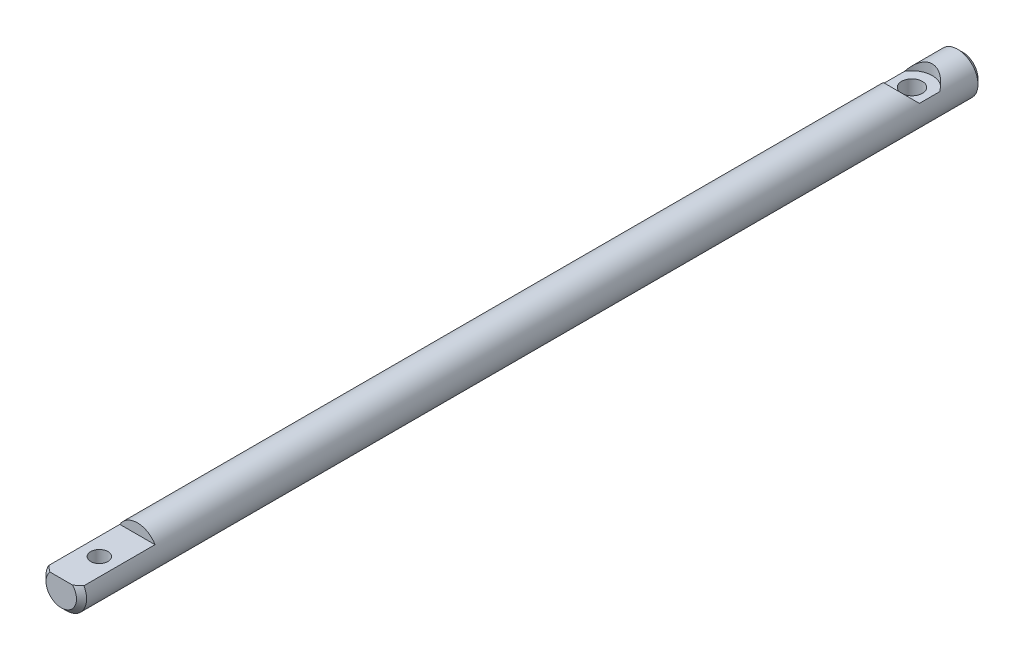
ISO-10303-21;
HEADER;
FILE_DESCRIPTION(('STEP AP214'),'2;1');
FILE_NAME('part.step','',(''),(''),'','','');
FILE_SCHEMA(('AUTOMOTIVE_DESIGN { 1 0 10303 214 1 1 1 1 }'));
ENDSEC;
DATA;
#1=APPLICATION_CONTEXT('core data for automotive mechanical design processes');
#2=APPLICATION_PROTOCOL_DEFINITION('international standard','automotive_design',2000,#1);
#3=PRODUCT_CONTEXT('',#1,'mechanical');
#4=PRODUCT('Part','Part','',(#3));
#5=PRODUCT_RELATED_PRODUCT_CATEGORY('part','',(#4));
#6=PRODUCT_DEFINITION_FORMATION('','',#4);
#7=PRODUCT_DEFINITION_CONTEXT('part definition',#1,'design');
#8=PRODUCT_DEFINITION('design','',#6,#7);
#9=PRODUCT_DEFINITION_SHAPE('','',#8);
#10=(LENGTH_UNIT() NAMED_UNIT(*) SI_UNIT(.MILLI.,.METRE.));
#11=(NAMED_UNIT(*) PLANE_ANGLE_UNIT() SI_UNIT($,.RADIAN.));
#12=(NAMED_UNIT(*) SI_UNIT($,.STERADIAN.) SOLID_ANGLE_UNIT());
#13=UNCERTAINTY_MEASURE_WITH_UNIT(LENGTH_MEASURE(1.E-05),#10,'distance_accuracy_value','');
#14=(GEOMETRIC_REPRESENTATION_CONTEXT(3) GLOBAL_UNCERTAINTY_ASSIGNED_CONTEXT((#13)) GLOBAL_UNIT_ASSIGNED_CONTEXT((#10,
#11,#12)) REPRESENTATION_CONTEXT('',''));
#15=CARTESIAN_POINT('',(0.,0.,0.));
#16=DIRECTION('',(0.,0.,1.));
#17=DIRECTION('',(1.,0.,0.));
#18=AXIS2_PLACEMENT_3D('',#15,#16,#17);
#19=CARTESIAN_POINT('',(0.,0.,355.));
#20=DIRECTION('',(0.,0.,-1.));
#21=DIRECTION('',(-1.,0.,0.));
#22=AXIS2_PLACEMENT_3D('',#19,#20,#21);
#23=CYLINDRICAL_SURFACE('',#22,8.);
#24=CARTESIAN_POINT('',(0.,-8.,343.4));
#25=CARTESIAN_POINT('',(0.09094254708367,-7.99999921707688,343.399998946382));
#26=CARTESIAN_POINT('',(0.181917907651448,-7.99844346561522,343.39634381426));
#27=CARTESIAN_POINT('',(0.363195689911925,-7.99226793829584,343.381771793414));
#28=CARTESIAN_POINT('',(0.453497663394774,-7.98764627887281,343.370850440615));
#29=CARTESIAN_POINT('',(0.722727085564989,-7.96931026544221,343.327261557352));
#30=CARTESIAN_POINT('',(0.899738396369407,-7.95112529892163,343.28376952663));
#31=CARTESIAN_POINT('',(1.24264964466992,-7.90479388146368,343.169925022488));
#32=CARTESIAN_POINT('',(1.40858555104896,-7.87668175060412,343.099665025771));
#33=CARTESIAN_POINT('',(1.72618850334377,-7.8132255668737,342.934669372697));
#34=CARTESIAN_POINT('',(1.87785953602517,-7.77788354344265,342.839940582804));
#35=CARTESIAN_POINT('',(2.17068103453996,-7.70143718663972,342.623519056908));
#36=CARTESIAN_POINT('',(2.31099328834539,-7.66013924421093,342.500761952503));
#37=CARTESIAN_POINT('',(2.56976762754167,-7.57725465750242,342.23402134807));
#38=CARTESIAN_POINT('',(2.68821777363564,-7.53566786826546,342.090026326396));
#39=CARTESIAN_POINT('',(2.90595853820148,-7.45450317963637,341.775886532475));
#40=CARTESIAN_POINT('',(3.00394296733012,-7.41514010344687,341.604775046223));
#41=CARTESIAN_POINT('',(3.16936499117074,-7.34596652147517,341.246587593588));
#42=CARTESIAN_POINT('',(3.23681894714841,-7.31615090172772,341.059520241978));
#43=CARTESIAN_POINT('',(3.33577021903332,-7.27155199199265,340.684374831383));
#44=CARTESIAN_POINT('',(3.3688832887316,-7.25609717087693,340.49680595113));
#45=CARTESIAN_POINT('',(3.40324961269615,-7.24004769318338,340.118186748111));
#46=CARTESIAN_POINT('',(3.40452147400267,-7.2394443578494,339.927138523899));
#47=CARTESIAN_POINT('',(3.37638260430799,-7.25260004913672,339.563385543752));
#48=CARTESIAN_POINT('',(3.34942959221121,-7.26520868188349,339.390440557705));
#49=CARTESIAN_POINT('',(3.26974117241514,-7.30141681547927,339.051811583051));
#50=CARTESIAN_POINT('',(3.21700058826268,-7.3250185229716,338.886129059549));
#51=CARTESIAN_POINT('',(3.08619769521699,-7.3810921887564,338.562458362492));
#52=CARTESIAN_POINT('',(3.00761142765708,-7.41374528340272,338.404714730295));
#53=CARTESIAN_POINT('',(2.82772003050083,-7.48420446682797,338.10402377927));
#54=CARTESIAN_POINT('',(2.72640574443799,-7.52201263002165,337.961082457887));
#55=CARTESIAN_POINT('',(2.49344288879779,-7.602579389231,337.680773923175));
#56=CARTESIAN_POINT('',(2.35990618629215,-7.64548038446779,337.545012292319));
#57=CARTESIAN_POINT('',(2.07155336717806,-7.72859409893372,337.297258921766));
#58=CARTESIAN_POINT('',(1.91673187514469,-7.76880613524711,337.185273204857));
#59=CARTESIAN_POINT('',(1.5851569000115,-7.84326580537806,336.985764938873));
#60=CARTESIAN_POINT('',(1.40795338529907,-7.87734004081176,336.898920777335));
#61=CARTESIAN_POINT('',(1.0396330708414,-7.93434300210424,336.756843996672));
#62=CARTESIAN_POINT('',(0.848524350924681,-7.95727814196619,336.701593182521));
#63=CARTESIAN_POINT('',(0.471214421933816,-7.98820555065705,336.627690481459));
#64=CARTESIAN_POINT('',(0.285506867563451,-7.99707532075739,336.606885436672));
#65=CARTESIAN_POINT('',(-0.086943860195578,-8.0016925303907,336.596014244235));
#66=CARTESIAN_POINT('',(-0.273686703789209,-7.99744393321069,336.605938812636));
#67=CARTESIAN_POINT('',(-0.632656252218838,-7.9768675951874,336.654726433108));
#68=CARTESIAN_POINT('',(-0.805132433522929,-7.96118050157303,336.692055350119));
#69=CARTESIAN_POINT('',(-1.14117130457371,-7.92000024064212,336.792432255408));
#70=CARTESIAN_POINT('',(-1.30473287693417,-7.89450584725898,336.855483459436));
#71=CARTESIAN_POINT('',(-1.62406863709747,-7.83515237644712,337.007566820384));
#72=CARTESIAN_POINT('',(-1.77944074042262,-7.8010571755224,337.097348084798));
#73=CARTESIAN_POINT('',(-2.07347297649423,-7.72811073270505,337.299522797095));
#74=CARTESIAN_POINT('',(-2.21212597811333,-7.68925747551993,337.411925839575));
#75=CARTESIAN_POINT('',(-2.47960841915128,-7.6073999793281,337.665899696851));
#76=CARTESIAN_POINT('',(-2.60694543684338,-7.56430165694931,337.80901596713));
#77=CARTESIAN_POINT('',(-2.8362370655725,-7.48135433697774,338.115230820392));
#78=CARTESIAN_POINT('',(-2.9381850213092,-7.44150619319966,338.278334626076));
#79=CARTESIAN_POINT('',(-3.11516255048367,-7.36919895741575,338.623764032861));
#80=CARTESIAN_POINT('',(-3.18971126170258,-7.33687520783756,338.806366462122));
#81=CARTESIAN_POINT('',(-3.30634430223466,-7.28506932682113,339.183344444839));
#82=CARTESIAN_POINT('',(-3.34845686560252,-7.26557602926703,339.377709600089));
#83=CARTESIAN_POINT('',(-3.39616357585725,-7.2433902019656,339.756068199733));
#84=CARTESIAN_POINT('',(-3.40439189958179,-7.23948653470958,339.939659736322));
#85=CARTESIAN_POINT('',(-3.39118684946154,-7.24568206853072,340.305512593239));
#86=CARTESIAN_POINT('',(-3.36975849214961,-7.25577890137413,340.487774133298));
#87=CARTESIAN_POINT('',(-3.30009044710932,-7.28771189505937,340.836308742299));
#88=CARTESIAN_POINT('',(-3.25325576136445,-7.30893106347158,341.002924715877));
#89=CARTESIAN_POINT('',(-3.13550889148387,-7.36020954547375,341.32595617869));
#90=CARTESIAN_POINT('',(-3.06458988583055,-7.39027136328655,341.482368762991));
#91=CARTESIAN_POINT('',(-2.89568117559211,-7.45813580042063,341.79105143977));
#92=CARTESIAN_POINT('',(-2.79629603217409,-7.49630051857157,341.942476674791));
#93=CARTESIAN_POINT('',(-2.57517933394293,-7.57510460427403,342.227325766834));
#94=CARTESIAN_POINT('',(-2.45343953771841,-7.61574488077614,342.360742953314));
#95=CARTESIAN_POINT('',(-2.17997991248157,-7.6986775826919,342.616366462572));
#96=CARTESIAN_POINT('',(-2.02667281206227,-7.74085601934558,342.736916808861));
#97=CARTESIAN_POINT('',(-1.70035343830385,-7.81900500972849,342.950725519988));
#98=CARTESIAN_POINT('',(-1.52733227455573,-7.85497274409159,343.043971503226));
#99=CARTESIAN_POINT('',(-1.25808018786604,-7.9009768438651,343.16016577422));
#100=CARTESIAN_POINT('',(-1.16739003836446,-7.91491510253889,343.194786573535));
#101=CARTESIAN_POINT('',(-0.983036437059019,-7.93991589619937,343.256233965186));
#102=CARTESIAN_POINT('',(-0.889374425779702,-7.95097980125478,343.283064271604));
#103=CARTESIAN_POINT('',(-0.700027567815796,-7.96988077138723,343.328577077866));
#104=CARTESIAN_POINT('',(-0.604348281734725,-7.97772573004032,343.34727951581));
#105=CARTESIAN_POINT('',(-0.411567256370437,-7.98998906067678,343.376403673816));
#106=CARTESIAN_POINT('',(-0.314466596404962,-7.99440990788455,343.386831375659));
#107=CARTESIAN_POINT('',(-0.180959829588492,-7.99803498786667,343.395374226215));
#108=CARTESIAN_POINT('',(-0.144795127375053,-7.99877139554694,343.39710832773));
#109=CARTESIAN_POINT('',(-0.0724220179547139,-7.99975405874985,343.399421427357));
#110=CARTESIAN_POINT('',(-0.0362136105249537,-8.00000031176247,343.400000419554));
#111=CARTESIAN_POINT('',(0.,-8.,343.4));
#112=B_SPLINE_CURVE_WITH_KNOTS('',3,(#24,#25,#26,#27,#28,#29,#30,#31,#32,#33,#34,#35,#36,#37,
#38,#39,#40,#41,#42,#43,#44,#45,#46,#47,#48,#49,#50,#51,#52,#53,#54,#55,#56,#57,#58,#59,#60,#61,
#62,#63,#64,#65,#66,#67,#68,#69,#70,#71,#72,#73,#74,#75,#76,#77,#78,#79,#80,#81,#82,#83,#84,#85,
#86,#87,#88,#89,#90,#91,#92,#93,#94,#95,#96,#97,#98,#99,#100,#101,#102,#103,#104,#105,#106,#107,
#108,#109,#110,#111),.UNSPECIFIED.,.T.,.F.,(4,2,2,2,2,2,2,2,2,2,2,2,2,2,2,2,2,2,2,2,2,2,2,2,2,2,
2,2,2,2,2,2,2,2,2,2,2,2,2,2,2,2,2,4),(0.,0.272787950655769,0.545743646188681,1.09236438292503,
1.63711355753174,2.1817100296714,2.75209343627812,3.32278742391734,3.92296880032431,
4.52282815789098,5.09297031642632,5.66277929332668,6.18679320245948,6.71091234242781,
7.24638921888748,7.78208221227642,8.36505761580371,8.94818051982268,9.54581973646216,
10.1431144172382,10.7014292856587,11.2595754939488,11.7886515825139,12.3177938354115,
12.8634424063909,13.4093228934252,13.9957102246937,14.582251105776,15.1786431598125,
15.7745154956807,16.3230734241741,16.8715385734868,17.3923747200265,17.9133585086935,
18.4663494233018,19.0195446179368,19.6153656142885,20.2114563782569,20.505338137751,
20.7990795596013,21.0920962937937,21.384901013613,21.4935254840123,21.6021505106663),.UNSPECIFIED.);
#113=CARTESIAN_POINT('',(0.,-8.00000000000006,336.6));
#114=VERTEX_POINT('',#113);
#115=CARTESIAN_POINT('',(0.,-8.,343.4));
#116=VERTEX_POINT('',#115);
#117=EDGE_CURVE('E37',#114,#116,#112,.T.);
#118=ORIENTED_EDGE('',*,*,#117,.T.);
#119=EDGE_CURVE('E11',#116,#114,#112,.T.);
#120=ORIENTED_EDGE('',*,*,#119,.T.);
#121=EDGE_LOOP('',(#118,#120));
#122=FACE_BOUND('',#121,.T.);
#123=DIRECTION('',(0.,0.,-1.));
#124=VECTOR('',#123,1.);
#125=CARTESIAN_POINT('',(-6.92820323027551,3.99999999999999,355.));
#126=LINE('',#125,#124);
#127=CARTESIAN_POINT('',(-6.92820323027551,3.99999999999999,353.));
#128=VERTEX_POINT('',#127);
#129=CARTESIAN_POINT('',(-6.92820323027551,4.,325.));
#130=VERTEX_POINT('',#129);
#131=EDGE_CURVE('E95',#128,#130,#126,.T.);
#132=ORIENTED_EDGE('',*,*,#131,.T.);
#133=CARTESIAN_POINT('',(0.,0.,325.));
#134=DIRECTION('',(0.,0.,-1.));
#135=DIRECTION('',(-1.,0.,0.));
#136=AXIS2_PLACEMENT_3D('',#133,#134,#135);
#137=CIRCLE('',#136,8.);
#138=CARTESIAN_POINT('',(6.92820323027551,4.,325.));
#139=VERTEX_POINT('',#138);
#140=EDGE_CURVE('E87',#130,#139,#137,.T.);
#141=ORIENTED_EDGE('',*,*,#140,.T.);
#142=DIRECTION('',(0.,0.,-1.));
#143=VECTOR('',#142,1.);
#144=CARTESIAN_POINT('',(6.92820323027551,3.99999999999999,355.));
#145=LINE('',#144,#143);
#146=CARTESIAN_POINT('',(6.92820323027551,3.99999999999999,353.));
#147=VERTEX_POINT('',#146);
#148=EDGE_CURVE('E188',#139,#147,#145,.F.);
#149=ORIENTED_EDGE('',*,*,#148,.T.);
#150=CARTESIAN_POINT('',(0.,0.,353.));
#151=DIRECTION('',(0.,0.,1.));
#152=DIRECTION('',(1.,0.,0.));
#153=AXIS2_PLACEMENT_3D('',#150,#151,#152);
#154=CIRCLE('',#153,8.);
#155=EDGE_CURVE('E151',#147,#128,#154,.F.);
#156=ORIENTED_EDGE('',*,*,#155,.T.);
#157=EDGE_LOOP('',(#132,#141,#149,#156));
#158=FACE_BOUND('',#157,.T.);
#159=CARTESIAN_POINT('',(0.,0.,2.00000000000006));
#160=DIRECTION('',(0.,0.,1.));
#161=DIRECTION('',(1.,0.,0.));
#162=AXIS2_PLACEMENT_3D('',#159,#160,#161);
#163=CIRCLE('',#162,8.);
#164=CARTESIAN_POINT('',(8.,0.,2.00000000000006));
#165=VERTEX_POINT('',#164);
#166=EDGE_CURVE('E99',#165,#165,#163,.T.);
#167=ORIENTED_EDGE('',*,*,#166,.T.);
#168=EDGE_LOOP('',(#167));
#169=FACE_BOUND('',#168,.T.);
#170=CARTESIAN_POINT('',(0.,-8.,24.1));
#171=CARTESIAN_POINT('',(0.107494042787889,-7.99999985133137,24.0999998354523));
#172=CARTESIAN_POINT('',(0.214990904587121,-7.99782841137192,24.0957676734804));
#173=CARTESIAN_POINT('',(0.429187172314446,-7.98919866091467,24.0788903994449));
#174=CARTESIAN_POINT('',(0.53588624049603,-7.98273862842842,24.0662419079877));
#175=CARTESIAN_POINT('',(0.74778503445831,-7.96568411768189,24.0326585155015));
#176=CARTESIAN_POINT('',(0.852982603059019,-7.95508421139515,24.0117127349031));
#177=CARTESIAN_POINT('',(1.06099795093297,-7.93002449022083,23.9617857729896));
#178=CARTESIAN_POINT('',(1.16381473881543,-7.91556309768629,23.9328013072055));
#179=CARTESIAN_POINT('',(1.46675025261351,-7.86703166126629,23.8345121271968));
#180=CARTESIAN_POINT('',(1.66243590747,-7.82772192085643,23.7536966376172));
#181=CARTESIAN_POINT('',(2.03705065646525,-7.73870988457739,23.5643494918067));
#182=CARTESIAN_POINT('',(2.2159805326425,-7.68900807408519,23.4558191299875));
#183=CARTESIAN_POINT('',(2.56475195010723,-7.58006903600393,23.2063698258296));
#184=CARTESIAN_POINT('',(2.73332265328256,-7.52042958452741,23.0638482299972));
#185=CARTESIAN_POINT('',(3.04532910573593,-7.39959668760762,22.7539850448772));
#186=CARTESIAN_POINT('',(3.18874465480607,-7.33840203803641,22.5866237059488));
#187=CARTESIAN_POINT('',(3.4583432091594,-7.21551020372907,22.2150981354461));
#188=CARTESIAN_POINT('',(3.58212768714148,-7.15418823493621,22.0090366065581));
#189=CARTESIAN_POINT('',(3.74004025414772,-7.07217287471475,21.6842337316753));
#190=CARTESIAN_POINT('',(3.78806176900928,-7.04648880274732,21.5733081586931));
#191=CARTESIAN_POINT('',(3.87434995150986,-6.99941617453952,21.346871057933));
#192=CARTESIAN_POINT('',(3.91262252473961,-6.97802501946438,21.2313623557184));
#193=CARTESIAN_POINT('',(3.97689452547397,-6.94158437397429,21.0037158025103));
#194=CARTESIAN_POINT('',(4.0034962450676,-6.92622958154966,20.8917966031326));
#195=CARTESIAN_POINT('',(4.0472519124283,-6.90075324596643,20.6655903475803));
#196=CARTESIAN_POINT('',(4.06441099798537,-6.89062885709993,20.5513046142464));
#197=CARTESIAN_POINT('',(4.08901604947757,-6.87605656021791,20.3214080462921));
#198=CARTESIAN_POINT('',(4.09646859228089,-6.87160480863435,20.2057981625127));
#199=CARTESIAN_POINT('',(4.10155356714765,-6.86857105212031,19.9742925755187));
#200=CARTESIAN_POINT('',(4.09918702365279,-6.86998843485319,19.8583969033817));
#201=CARTESIAN_POINT('',(4.08560387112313,-6.87807325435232,19.642187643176));
#202=CARTESIAN_POINT('',(4.0755550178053,-6.88404773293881,19.5417727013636));
#203=CARTESIAN_POINT('',(4.0481543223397,-6.90019495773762,19.3422763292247));
#204=CARTESIAN_POINT('',(4.03080020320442,-6.91036901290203,19.2431953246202));
#205=CARTESIAN_POINT('',(3.96805760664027,-6.94672036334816,18.9489791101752));
#206=CARTESIAN_POINT('',(3.9119795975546,-6.97873289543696,18.7567282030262));
#207=CARTESIAN_POINT('',(3.77199067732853,-7.05538983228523,18.3802966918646));
#208=CARTESIAN_POINT('',(3.68746618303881,-7.10030920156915,18.1964054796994));
#209=CARTESIAN_POINT('',(3.49344117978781,-7.19775253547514,17.8444823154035));
#210=CARTESIAN_POINT('',(3.38392944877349,-7.25027991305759,17.6764575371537));
#211=CARTESIAN_POINT('',(3.12597058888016,-7.36551680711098,17.3373689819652));
#212=CARTESIAN_POINT('',(2.97427140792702,-7.42864709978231,17.1689198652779));
#213=CARTESIAN_POINT('',(2.64447217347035,-7.55233152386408,16.8586668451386));
#214=CARTESIAN_POINT('',(2.46635834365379,-7.61288428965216,16.7168769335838));
#215=CARTESIAN_POINT('',(2.17730820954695,-7.69871350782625,16.5238361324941));
#216=CARTESIAN_POINT('',(2.07452946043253,-7.72711013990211,16.4615186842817));
#217=CARTESIAN_POINT('',(1.86327042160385,-7.78075019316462,16.345864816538));
#218=CARTESIAN_POINT('',(1.75479257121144,-7.80599494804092,16.2925245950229));
#219=CARTESIAN_POINT('',(1.53288844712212,-7.85258587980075,16.1954082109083));
#220=CARTESIAN_POINT('',(1.41946431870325,-7.87393372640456,16.1516279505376));
#221=CARTESIAN_POINT('',(1.18848379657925,-7.9120919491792,16.0741449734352));
#222=CARTESIAN_POINT('',(1.07092790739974,-7.92890287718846,16.0404410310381));
#223=CARTESIAN_POINT('',(0.842886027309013,-7.95622918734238,15.9860136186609));
#224=CARTESIAN_POINT('',(0.732655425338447,-7.96716007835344,15.9644264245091));
#225=CARTESIAN_POINT('',(0.510447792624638,-7.98447602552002,15.9303472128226));
#226=CARTESIAN_POINT('',(0.398470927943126,-7.99086151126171,15.9178543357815));
#227=CARTESIAN_POINT('',(0.173745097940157,-7.99890299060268,15.9021353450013));
#228=CARTESIAN_POINT('',(0.0609964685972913,-8.00056092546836,15.8989054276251));
#229=CARTESIAN_POINT('',(-0.164348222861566,-7.99910527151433,15.9017459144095));
#230=CARTESIAN_POINT('',(-0.276944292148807,-7.99599191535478,15.9078158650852));
#231=CARTESIAN_POINT('',(-0.491764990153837,-7.98553405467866,15.9282896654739));
#232=CARTESIAN_POINT('',(-0.594077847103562,-7.9785604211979,15.9419634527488));
#233=CARTESIAN_POINT('',(-0.79707646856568,-7.96084639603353,15.9769048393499));
#234=CARTESIAN_POINT('',(-0.897761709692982,-7.9501048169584,15.9981748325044));
#235=CARTESIAN_POINT('',(-1.19630409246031,-7.91258038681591,16.0730607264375));
#236=CARTESIAN_POINT('',(-1.39083941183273,-7.88048785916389,16.1377712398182));
#237=CARTESIAN_POINT('',(-1.77127206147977,-7.80393386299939,16.29644479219));
#238=CARTESIAN_POINT('',(-1.9567863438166,-7.75915740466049,16.3911611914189));
#239=CARTESIAN_POINT('',(-2.30990783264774,-7.66145609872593,16.6063163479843));
#240=CARTESIAN_POINT('',(-2.47750756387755,-7.60852787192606,16.7267657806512));
#241=CARTESIAN_POINT('',(-2.80811596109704,-7.49320958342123,17.0040533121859));
#242=CARTESIAN_POINT('',(-2.96891712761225,-7.43040492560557,17.1633485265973));
#243=CARTESIAN_POINT('',(-3.26261722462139,-7.30621543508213,17.5067378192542));
#244=CARTESIAN_POINT('',(-3.39549442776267,-7.24483174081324,17.6908510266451));
#245=CARTESIAN_POINT('',(-3.57452458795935,-7.15734131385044,17.9882370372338));
#246=CARTESIAN_POINT('',(-3.6320186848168,-7.12825317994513,18.0939562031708));
#247=CARTESIAN_POINT('',(-3.73776067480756,-7.07337884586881,18.3107201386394));
#248=CARTESIAN_POINT('',(-3.78601303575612,-7.04759105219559,18.4217623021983));
#249=CARTESIAN_POINT('',(-3.87270761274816,-7.00032687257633,18.6483916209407));
#250=CARTESIAN_POINT('',(-3.91115811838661,-6.97884684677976,18.7639748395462));
#251=CARTESIAN_POINT('',(-3.9777745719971,-6.94109356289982,18.9988973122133));
#252=CARTESIAN_POINT('',(-4.00594220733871,-6.92481945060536,19.1182359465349));
#253=CARTESIAN_POINT('',(-4.0493220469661,-6.89953314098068,19.3478605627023));
#254=CARTESIAN_POINT('',(-4.06552760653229,-6.88996872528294,19.4578985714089));
#255=CARTESIAN_POINT('',(-4.08894892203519,-6.87609507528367,19.6792500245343));
#256=CARTESIAN_POINT('',(-4.09616572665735,-6.87178522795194,19.7905633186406));
#257=CARTESIAN_POINT('',(-4.10149172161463,-6.868608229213,20.0134459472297));
#258=CARTESIAN_POINT('',(-4.09960467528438,-6.86973882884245,20.1250151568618));
#259=CARTESIAN_POINT('',(-4.08677499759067,-6.8773767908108,20.3474124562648));
#260=CARTESIAN_POINT('',(-4.07583281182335,-6.88388388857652,20.4582405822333));
#261=CARTESIAN_POINT('',(-4.03286837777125,-6.90920284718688,20.7651000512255));
#262=CARTESIAN_POINT('',(-3.99102683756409,-6.93367175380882,20.9593906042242));
#263=CARTESIAN_POINT('',(-3.88062506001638,-6.99604814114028,21.3378025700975));
#264=CARTESIAN_POINT('',(-3.81205583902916,-7.03396013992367,21.5219205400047));
#265=CARTESIAN_POINT('',(-3.64507803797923,-7.12199932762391,21.8885517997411));
#266=CARTESIAN_POINT('',(-3.54498529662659,-7.17277223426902,22.0701402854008));
#267=CARTESIAN_POINT('',(-3.31957991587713,-7.27983114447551,22.4151405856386));
#268=CARTESIAN_POINT('',(-3.19425386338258,-7.3361200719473,22.5785426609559));
#269=CARTESIAN_POINT('',(-2.9029110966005,-7.4566128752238,22.9046401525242));
#270=CARTESIAN_POINT('',(-2.73372285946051,-7.52089462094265,23.0644835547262));
#271=CARTESIAN_POINT('',(-2.36915356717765,-7.64355894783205,23.3542898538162));
#272=CARTESIAN_POINT('',(-2.17375756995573,-7.70193813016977,23.484235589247));
#273=CARTESIAN_POINT('',(-1.86313604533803,-7.78077269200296,23.6541694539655));
#274=CARTESIAN_POINT('',(-1.75586431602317,-7.8057377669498,23.7069278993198));
#275=CARTESIAN_POINT('',(-1.53645076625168,-7.85186937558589,23.8031094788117));
#276=CARTESIAN_POINT('',(-1.42431137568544,-7.87303777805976,23.8465372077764));
#277=CARTESIAN_POINT('',(-1.19621878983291,-7.91090411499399,23.9234577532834));
#278=CARTESIAN_POINT('',(-1.0802742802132,-7.92761153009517,23.9569716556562));
#279=CARTESIAN_POINT('',(-0.845359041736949,-7.95608880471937,24.0137206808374));
#280=CARTESIAN_POINT('',(-0.726390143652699,-7.96786157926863,24.0369618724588));
#281=CARTESIAN_POINT('',(-0.506292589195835,-7.98459541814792,24.0698804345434));
#282=CARTESIAN_POINT('',(-0.405461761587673,-7.99036024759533,24.0811637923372));
#283=CARTESIAN_POINT('',(-0.203088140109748,-7.99806265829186,24.0962237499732));
#284=CARTESIAN_POINT('',(-0.101545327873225,-8.00000014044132,24.1000001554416));
#285=CARTESIAN_POINT('',(0.,-8.,24.1));
#286=B_SPLINE_CURVE_WITH_KNOTS('',3,(#170,#171,#172,#173,#174,#175,#176,#177,#178,#179,#180,
#181,#182,#183,#184,#185,#186,#187,#188,#189,#190,#191,#192,#193,#194,#195,#196,#197,#198,#199,
#200,#201,#202,#203,#204,#205,#206,#207,#208,#209,#210,#211,#212,#213,#214,#215,#216,#217,#218,
#219,#220,#221,#222,#223,#224,#225,#226,#227,#228,#229,#230,#231,#232,#233,#234,#235,#236,#237,
#238,#239,#240,#241,#242,#243,#244,#245,#246,#247,#248,#249,#250,#251,#252,#253,#254,#255,#256,
#257,#258,#259,#260,#261,#262,#263,#264,#265,#266,#267,#268,#269,#270,#271,#272,#273,#274,#275,
#276,#277,#278,#279,#280,#281,#282,#283,#284,#285),.UNSPECIFIED.,.T.,.F.,(4,2,2,2,2,2,2,2,2,2,2,
2,2,2,2,2,2,2,2,2,2,2,2,2,2,2,2,2,2,2,2,2,2,2,2,2,2,2,2,2,2,2,2,2,2,2,2,2,2,2,2,2,2,2,2,2,2,4),
(0.,0.32238186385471,0.644893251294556,0.967828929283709,1.29089674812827,1.93377512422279,
2.57662348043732,3.25972894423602,3.94338047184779,4.68344529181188,5.05372414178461,
5.42377815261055,5.77145096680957,6.11893442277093,6.4661823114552,6.81339397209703,
7.11630304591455,7.41930660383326,8.02489028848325,8.6444765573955,9.2643416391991,
9.9673399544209,10.6707062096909,11.0408028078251,11.4107422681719,11.780522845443,
12.1502584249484,12.4883673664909,12.8264443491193,13.1643824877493,13.5023041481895,
13.8123037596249,14.1224011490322,14.742024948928,15.3786366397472,16.0155129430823,
16.7172767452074,17.4195845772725,17.7905885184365,18.1614126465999,18.5319221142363,
18.9023707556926,19.2368013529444,19.5711929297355,19.9054462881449,20.239683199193,
20.8375334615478,21.4355848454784,22.0734954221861,22.7117459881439,23.43294922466,
24.1545654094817,24.5205079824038,24.8862699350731,25.2512482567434,25.6160106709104,
25.9205440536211,26.2250853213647),.UNSPECIFIED.);
#287=CARTESIAN_POINT('',(0.,-8.,24.1));
#288=VERTEX_POINT('',#287);
#289=EDGE_CURVE('E103',#288,#288,#286,.T.);
#290=ORIENTED_EDGE('',*,*,#289,.T.);
#291=EDGE_LOOP('',(#290));
#292=FACE_BOUND('',#291,.T.);
#293=DIRECTION('',(0.,0.,-1.));
#294=VECTOR('',#293,1.);
#295=CARTESIAN_POINT('',(6.92820323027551,4.,355.));
#296=LINE('',#295,#294);
#297=CARTESIAN_POINT('',(6.92820323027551,4.,24.));
#298=VERTEX_POINT('',#297);
#299=CARTESIAN_POINT('',(6.92820323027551,4.,16.));
#300=VERTEX_POINT('',#299);
#301=EDGE_CURVE('E107',#298,#300,#296,.T.);
#302=ORIENTED_EDGE('',*,*,#301,.F.);
#303=CARTESIAN_POINT('',(0.,0.,20.));
#304=DIRECTION('',(0.,0.707106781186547,-0.707106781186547));
#305=DIRECTION('',(0.,-0.707106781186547,-0.707106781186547));
#306=AXIS2_PLACEMENT_3D('',#303,#304,#305);
#307=ELLIPSE('',#306,11.3137084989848,8.);
#308=CARTESIAN_POINT('',(-6.92820323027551,4.,24.));
#309=VERTEX_POINT('',#308);
#310=EDGE_CURVE('E109',#309,#298,#307,.T.);
#311=ORIENTED_EDGE('',*,*,#310,.F.);
#312=DIRECTION('',(0.,0.,-1.));
#313=VECTOR('',#312,1.);
#314=CARTESIAN_POINT('',(-6.92820323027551,4.,355.));
#315=LINE('',#314,#313);
#316=CARTESIAN_POINT('',(-6.92820323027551,4.,16.));
#317=VERTEX_POINT('',#316);
#318=EDGE_CURVE('E115',#317,#309,#315,.F.);
#319=ORIENTED_EDGE('',*,*,#318,.F.);
#320=CARTESIAN_POINT('',(0.,0.,20.));
#321=DIRECTION('',(0.,-0.707106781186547,-0.707106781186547));
#322=DIRECTION('',(0.,0.707106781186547,-0.707106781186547));
#323=AXIS2_PLACEMENT_3D('',#320,#321,#322);
#324=ELLIPSE('',#323,11.3137084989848,8.);
#325=EDGE_CURVE('E111',#300,#317,#324,.F.);
#326=ORIENTED_EDGE('',*,*,#325,.F.);
#327=EDGE_LOOP('',(#302,#311,#319,#326));
#328=FACE_BOUND('',#327,.T.);
#329=ADVANCED_FACE('F33',(#122,#158,#169,#292,#328),#23,.T.);
#330=CARTESIAN_POINT('',(0.,-8.,20.));
#331=DIRECTION('',(0.,1.,0.));
#332=DIRECTION('',(0.,0.,1.));
#333=AXIS2_PLACEMENT_3D('',#330,#331,#332);
#334=CYLINDRICAL_SURFACE('',#333,4.1);
#335=ORIENTED_EDGE('',*,*,#289,.F.);
#336=EDGE_LOOP('',(#335));
#337=FACE_BOUND('',#336,.T.);
#338=CARTESIAN_POINT('',(0.,4.,20.));
#339=DIRECTION('',(0.,1.,0.));
#340=DIRECTION('',(0.,0.,1.));
#341=AXIS2_PLACEMENT_3D('',#338,#339,#340);
#342=CIRCLE('',#341,4.1);
#343=CARTESIAN_POINT('',(0.,4.,24.1));
#344=VERTEX_POINT('',#343);
#345=EDGE_CURVE('E118',#344,#344,#342,.F.);
#346=ORIENTED_EDGE('',*,*,#345,.F.);
#347=EDGE_LOOP('',(#346));
#348=FACE_BOUND('',#347,.T.);
#349=ADVANCED_FACE('F90',(#337,#348),#334,.F.);
#350=CARTESIAN_POINT('',(0.,0.,355.));
#351=DIRECTION('',(0.,0.,1.));
#352=DIRECTION('',(1.,0.,0.));
#353=AXIS2_PLACEMENT_3D('',#350,#351,#352);
#354=PLANE('',#353);
#355=DIRECTION('',(1.,0.,0.));
#356=VECTOR('',#355,1.);
#357=CARTESIAN_POINT('',(-8.,3.99999999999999,355.));
#358=LINE('',#357,#356);
#359=CARTESIAN_POINT('',(-4.47213595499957,3.99999999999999,355.));
#360=VERTEX_POINT('',#359);
#361=CARTESIAN_POINT('',(4.47213595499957,3.99999999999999,355.));
#362=VERTEX_POINT('',#361);
#363=EDGE_CURVE('E57',#360,#362,#358,.T.);
#364=ORIENTED_EDGE('',*,*,#363,.F.);
#365=CARTESIAN_POINT('',(0.,0.,355.));
#366=DIRECTION('',(0.,0.,1.));
#367=DIRECTION('',(1.,0.,0.));
#368=AXIS2_PLACEMENT_3D('',#365,#366,#367);
#369=CIRCLE('',#368,5.99999999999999);
#370=EDGE_CURVE('E204',#360,#362,#369,.T.);
#371=ORIENTED_EDGE('',*,*,#370,.T.);
#372=EDGE_LOOP('',(#364,#371));
#373=FACE_BOUND('',#372,.T.);
#374=ADVANCED_FACE('F132',(#373),#354,.T.);
#375=CARTESIAN_POINT('',(0.,0.,0.));
#376=DIRECTION('',(0.,0.,1.));
#377=DIRECTION('',(1.,0.,0.));
#378=AXIS2_PLACEMENT_3D('',#375,#376,#377);
#379=PLANE('',#378);
#380=CARTESIAN_POINT('',(0.,0.,0.));
#381=DIRECTION('',(0.,0.,1.));
#382=DIRECTION('',(1.,0.,0.));
#383=AXIS2_PLACEMENT_3D('',#380,#381,#382);
#384=CIRCLE('',#383,5.99999999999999);
#385=CARTESIAN_POINT('',(5.99999999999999,0.,0.));
#386=VERTEX_POINT('',#385);
#387=EDGE_CURVE('E148',#386,#386,#384,.F.);
#388=ORIENTED_EDGE('',*,*,#387,.T.);
#389=EDGE_LOOP('',(#388));
#390=FACE_BOUND('',#389,.T.);
#391=ADVANCED_FACE('F137',(#390),#379,.F.);
#392=CARTESIAN_POINT('',(0.,8.,20.));
#393=DIRECTION('',(0.,-1.,0.));
#394=DIRECTION('',(0.,0.,-1.));
#395=AXIS2_PLACEMENT_3D('',#392,#393,#394);
#396=CYLINDRICAL_SURFACE('',#395,8.);
#397=CARTESIAN_POINT('',(0.,4.,20.));
#398=DIRECTION('',(0.,1.,0.));
#399=DIRECTION('',(0.,0.,1.));
#400=AXIS2_PLACEMENT_3D('',#397,#398,#399);
#401=CIRCLE('',#400,8.);
#402=EDGE_CURVE('E184',#300,#317,#401,.T.);
#403=ORIENTED_EDGE('',*,*,#402,.F.);
#404=ORIENTED_EDGE('',*,*,#325,.T.);
#405=EDGE_LOOP('',(#403,#404));
#406=FACE_BOUND('',#405,.T.);
#407=ADVANCED_FACE('F134',(#406),#396,.F.);
#408=ORIENTED_EDGE('',*,*,#310,.T.);
#409=EDGE_CURVE('E185',#309,#298,#401,.T.);
#410=ORIENTED_EDGE('',*,*,#409,.F.);
#411=EDGE_LOOP('',(#408,#410));
#412=FACE_BOUND('',#411,.T.);
#413=ADVANCED_FACE('F144',(#412),#396,.F.);
#414=CARTESIAN_POINT('',(0.,4.,20.));
#415=DIRECTION('',(0.,1.,0.));
#416=DIRECTION('',(0.,0.,1.));
#417=AXIS2_PLACEMENT_3D('',#414,#415,#416);
#418=PLANE('',#417);
#419=ORIENTED_EDGE('',*,*,#345,.T.);
#420=EDGE_LOOP('',(#419));
#421=FACE_BOUND('',#420,.T.);
#422=ORIENTED_EDGE('',*,*,#301,.T.);
#423=ORIENTED_EDGE('',*,*,#402,.T.);
#424=ORIENTED_EDGE('',*,*,#318,.T.);
#425=ORIENTED_EDGE('',*,*,#409,.T.);
#426=EDGE_LOOP('',(#422,#423,#424,#425));
#427=FACE_BOUND('',#426,.T.);
#428=ADVANCED_FACE('F172',(#421,#427),#418,.T.);
#429=CARTESIAN_POINT('',(0.,0.,355.));
#430=DIRECTION('',(0.,0.,-1.));
#431=DIRECTION('',(-1.,0.,0.));
#432=AXIS2_PLACEMENT_3D('',#429,#430,#431);
#433=CONICAL_SURFACE('',#432,5.99999999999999,0.785398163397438);
#434=CARTESIAN_POINT('',(-17.2163416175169,3.99999999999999,343.325090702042));
#435=CARTESIAN_POINT('',(-16.7844131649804,3.99999999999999,343.745786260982));
#436=CARTESIAN_POINT('',(-16.352104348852,3.99999999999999,344.166092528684));
#437=CARTESIAN_POINT('',(-15.4864484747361,3.99999999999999,345.005665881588));
#438=CARTESIAN_POINT('',(-15.053101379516,3.99999999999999,345.424932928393));
#439=CARTESIAN_POINT('',(-14.1840229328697,3.99999999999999,346.263197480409));
#440=CARTESIAN_POINT('',(-13.7482883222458,3.99999999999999,346.682191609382));
#441=CARTESIAN_POINT('',(-12.8751410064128,3.99999999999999,347.518402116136));
#442=CARTESIAN_POINT('',(-12.4377283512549,3.99999999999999,347.935618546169));
#443=CARTESIAN_POINT('',(-11.4905464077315,3.99999999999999,348.834205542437));
#444=CARTESIAN_POINT('',(-10.9803894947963,3.99999999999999,349.315168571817));
#445=CARTESIAN_POINT('',(-10.2118179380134,3.99999999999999,350.033096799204));
#446=CARTESIAN_POINT('',(-9.95505767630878,3.99999999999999,350.271832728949));
#447=CARTESIAN_POINT('',(-9.44016891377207,3.99999999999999,350.747823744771));
#448=CARTESIAN_POINT('',(-9.18204041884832,3.99999999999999,350.985078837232));
#449=CARTESIAN_POINT('',(-8.66457615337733,3.99999999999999,351.457269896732));
#450=CARTESIAN_POINT('',(-8.40524364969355,3.99999999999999,351.692209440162));
#451=CARTESIAN_POINT('',(-7.88443009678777,3.99999999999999,352.159692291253));
#452=CARTESIAN_POINT('',(-7.62294907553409,3.99999999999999,352.392235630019));
#453=CARTESIAN_POINT('',(-7.09725310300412,3.99999999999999,352.854127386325));
#454=CARTESIAN_POINT('',(-6.83303861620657,3.99999999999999,353.083476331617));
#455=CARTESIAN_POINT('',(-6.30096592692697,3.99999999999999,353.537899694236));
#456=CARTESIAN_POINT('',(-6.03310791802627,3.99999999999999,353.762974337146));
#457=CARTESIAN_POINT('',(-5.59057877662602,3.99999999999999,354.126501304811));
#458=CARTESIAN_POINT('',(-5.41737639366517,3.99999999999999,354.266739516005));
#459=CARTESIAN_POINT('',(-5.06848950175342,3.99999999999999,354.544121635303));
#460=CARTESIAN_POINT('',(-4.89280486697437,3.99999999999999,354.681265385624));
#461=CARTESIAN_POINT('',(-4.53776912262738,3.99999999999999,354.952016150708));
#462=CARTESIAN_POINT('',(-4.35840753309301,3.99999999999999,355.085609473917));
#463=CARTESIAN_POINT('',(-3.9958462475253,3.99999999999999,355.347474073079));
#464=CARTESIAN_POINT('',(-3.81264694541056,3.99999999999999,355.475745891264));
#465=CARTESIAN_POINT('',(-3.44710730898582,3.99999999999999,355.721290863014));
#466=CARTESIAN_POINT('',(-3.26491366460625,3.99999999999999,355.838780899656));
#467=CARTESIAN_POINT('',(-2.89474355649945,3.99999999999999,356.064616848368));
#468=CARTESIAN_POINT('',(-2.70676403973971,3.99999999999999,356.172957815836));
#469=CARTESIAN_POINT('',(-2.32493456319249,3.99999999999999,356.376222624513));
#470=CARTESIAN_POINT('',(-2.13112290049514,3.99999999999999,356.471217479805));
#471=CARTESIAN_POINT('',(-1.73578079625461,3.99999999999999,356.643235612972));
#472=CARTESIAN_POINT('',(-1.53426292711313,3.99999999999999,356.72028682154));
#473=CARTESIAN_POINT('',(-1.21277047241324,3.99999999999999,356.821640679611));
#474=CARTESIAN_POINT('',(-1.09543346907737,3.99999999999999,356.854312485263));
#475=CARTESIAN_POINT('',(-0.858521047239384,3.99999999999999,356.910522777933));
#476=CARTESIAN_POINT('',(-0.738945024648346,3.99999999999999,356.934058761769));
#477=CARTESIAN_POINT('',(-0.498676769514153,3.99999999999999,356.970775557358));
#478=CARTESIAN_POINT('',(-0.377990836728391,3.99999999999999,356.983997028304));
#479=CARTESIAN_POINT('',(-0.135916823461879,3.99999999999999,356.999513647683));
#480=CARTESIAN_POINT('',(-0.0145288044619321,3.99999999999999,357.001809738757));
#481=CARTESIAN_POINT('',(0.228086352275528,3.99999999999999,356.995340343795));
#482=CARTESIAN_POINT('',(0.349313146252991,3.99999999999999,356.98656217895));
#483=CARTESIAN_POINT('',(0.590520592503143,3.99999999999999,356.958421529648));
#484=CARTESIAN_POINT('',(0.710501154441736,3.99999999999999,356.939058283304));
#485=CARTESIAN_POINT('',(0.949005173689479,3.99999999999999,356.890631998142));
#486=CARTESIAN_POINT('',(1.06752001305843,3.99999999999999,356.861527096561));
#487=CARTESIAN_POINT('',(1.30213239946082,3.99999999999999,356.794897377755));
#488=CARTESIAN_POINT('',(1.41822984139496,3.99999999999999,356.75737219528));
#489=CARTESIAN_POINT('',(1.66766919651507,3.99999999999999,356.668105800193));
#490=CARTESIAN_POINT('',(1.80052971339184,3.99999999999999,356.615028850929));
#491=CARTESIAN_POINT('',(2.06283812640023,3.99999999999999,356.500962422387));
#492=CARTESIAN_POINT('',(2.19228442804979,3.99999999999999,356.439969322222));
#493=CARTESIAN_POINT('',(2.44820923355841,3.99999999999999,356.311561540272));
#494=CARTESIAN_POINT('',(2.57468218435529,3.99999999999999,356.244135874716));
#495=CARTESIAN_POINT('',(2.82476082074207,3.99999999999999,356.104232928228));
#496=CARTESIAN_POINT('',(2.94836690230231,3.99999999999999,356.03175635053));
#497=CARTESIAN_POINT('',(3.19393409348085,3.99999999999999,355.882220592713));
#498=CARTESIAN_POINT('',(3.31587797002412,3.99999999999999,355.805133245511));
#499=CARTESIAN_POINT('',(3.55758398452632,3.99999999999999,355.647616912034));
#500=CARTESIAN_POINT('',(3.67734606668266,3.99999999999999,355.567187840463));
#501=CARTESIAN_POINT('',(3.91485941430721,3.99999999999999,355.403687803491));
#502=CARTESIAN_POINT('',(4.03261268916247,3.99999999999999,355.32061974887));
#503=CARTESIAN_POINT('',(4.26648905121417,3.99999999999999,355.152234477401));
#504=CARTESIAN_POINT('',(4.38261219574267,3.99999999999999,355.06691733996));
#505=CARTESIAN_POINT('',(4.75344573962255,3.99999999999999,354.789823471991));
#506=CARTESIAN_POINT('',(5.00544314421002,3.99999999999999,354.594415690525));
#507=CARTESIAN_POINT('',(5.50446014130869,3.99999999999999,354.197326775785));
#508=CARTESIAN_POINT('',(5.75147900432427,3.99999999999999,353.995644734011));
#509=CARTESIAN_POINT('',(6.24186376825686,3.99999999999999,353.587688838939));
#510=CARTESIAN_POINT('',(6.48522807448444,3.99999999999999,353.381413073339));
#511=CARTESIAN_POINT('',(6.96908518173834,3.99999999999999,352.965518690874));
#512=CARTESIAN_POINT('',(7.20957791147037,3.99999999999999,352.755899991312));
#513=CARTESIAN_POINT('',(7.68869301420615,3.99999999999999,352.333793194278));
#514=CARTESIAN_POINT('',(7.92731189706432,3.99999999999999,352.121301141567));
#515=CARTESIAN_POINT('',(8.40276467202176,3.99999999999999,351.694326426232));
#516=CARTESIAN_POINT('',(8.63959854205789,3.99999999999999,351.479843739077));
#517=CARTESIAN_POINT('',(9.34783560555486,3.99999999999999,350.8341681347));
#518=CARTESIAN_POINT('',(9.81710291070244,3.99999999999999,350.400633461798));
#519=CARTESIAN_POINT('',(10.7503428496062,3.99999999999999,349.530840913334));
#520=CARTESIAN_POINT('',(11.2143274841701,3.99999999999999,349.094595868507));
#521=CARTESIAN_POINT('',(12.1396283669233,3.99999999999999,348.219228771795));
#522=CARTESIAN_POINT('',(12.6009444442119,3.99999999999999,347.780106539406));
#523=CARTESIAN_POINT('',(13.5212877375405,3.99999999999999,346.900101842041));
#524=CARTESIAN_POINT('',(13.9803163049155,3.99999999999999,346.459220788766));
#525=CARTESIAN_POINT('',(14.8968882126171,3.99999999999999,345.575917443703));
#526=CARTESIAN_POINT('',(15.3544315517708,3.99999999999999,345.133495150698));
#527=CARTESIAN_POINT('',(15.9286012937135,3.99999999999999,344.57686018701));
#528=CARTESIAN_POINT('',(16.0457639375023,3.99999999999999,344.463200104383));
#529=CARTESIAN_POINT('',(16.2800254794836,3.99999999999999,344.235798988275));
#530=CARTESIAN_POINT('',(16.3971243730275,3.99999999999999,344.122057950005));
#531=CARTESIAN_POINT('',(16.6312833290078,3.99999999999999,343.894479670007));
#532=CARTESIAN_POINT('',(16.7483433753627,3.99999999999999,343.780642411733));
#533=CARTESIAN_POINT('',(16.9823926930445,3.99999999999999,343.55291047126));
#534=CARTESIAN_POINT('',(17.0993819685,3.99999999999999,343.439015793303));
#535=CARTESIAN_POINT('',(17.2163416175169,3.99999999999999,343.325090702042));
#536=B_SPLINE_CURVE_WITH_KNOTS('',3,(#434,#435,#436,#437,#438,#439,#440,#441,#442,#443,#444,
#445,#446,#447,#448,#449,#450,#451,#452,#453,#454,#455,#456,#457,#458,#459,#460,#461,#462,#463,
#464,#465,#466,#467,#468,#469,#470,#471,#472,#473,#474,#475,#476,#477,#478,#479,#480,#481,#482,
#483,#484,#485,#486,#487,#488,#489,#490,#491,#492,#493,#494,#495,#496,#497,#498,#499,#500,#501,
#502,#503,#504,#505,#506,#507,#508,#509,#510,#511,#512,#513,#514,#515,#516,#517,#518,#519,#520,
#521,#522,#523,#524,#525,#526,#527,#528,#529,#530,#531,#532,#533,#534,#535),.UNSPECIFIED.,.F.,
.F.,(4,2,2,2,2,2,2,2,2,2,2,2,2,2,2,2,2,2,2,2,2,2,2,2,2,2,2,2,2,2,2,2,2,2,2,2,2,2,2,2,2,2,2,2,2,
2,2,2,2,2,4),(0.,1.80884661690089,3.61775909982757,5.43125615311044,7.24469952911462,
9.34807033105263,10.3998673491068,11.4516598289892,12.5014341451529,13.5511948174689,
14.6007799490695,15.6503095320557,16.3188577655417,16.9874400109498,17.658307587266,
18.3291066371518,18.9792865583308,19.6298156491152,20.2767403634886,20.9226512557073,
21.2877515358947,21.6529517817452,22.0167050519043,22.3804269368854,22.7445656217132,
23.1087305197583,23.4744808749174,23.8402470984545,24.2691311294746,24.6982120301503,
25.1280391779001,25.5578066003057,25.9905391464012,26.423282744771,26.8555645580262,
27.287831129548,28.2443142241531,29.2009364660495,30.1579646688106,31.1150165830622,
32.0735567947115,33.0321088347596,34.9486968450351,36.8592648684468,38.7699539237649,
40.6793342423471,42.5887160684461,43.07842138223,43.5681585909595,44.0580134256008,
44.5478362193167),.UNSPECIFIED.);
#537=EDGE_CURVE('E153',#128,#360,#536,.T.);
#538=ORIENTED_EDGE('',*,*,#537,.F.);
#539=ORIENTED_EDGE('',*,*,#155,.F.);
#540=EDGE_CURVE('E150',#362,#147,#536,.T.);
#541=ORIENTED_EDGE('',*,*,#540,.F.);
#542=ORIENTED_EDGE('',*,*,#370,.F.);
#543=EDGE_LOOP('',(#538,#539,#541,#542));
#544=FACE_BOUND('',#543,.T.);
#545=ADVANCED_FACE('F161',(#544),#433,.T.);
#546=CARTESIAN_POINT('',(0.,0.,2.00000000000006));
#547=DIRECTION('',(0.,0.,1.));
#548=DIRECTION('',(1.,0.,0.));
#549=AXIS2_PLACEMENT_3D('',#546,#547,#548);
#550=CONICAL_SURFACE('',#549,8.,0.785398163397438);
#551=ORIENTED_EDGE('',*,*,#387,.F.);
#552=EDGE_LOOP('',(#551));
#553=FACE_BOUND('',#552,.T.);
#554=ORIENTED_EDGE('',*,*,#166,.F.);
#555=EDGE_LOOP('',(#554));
#556=FACE_BOUND('',#555,.T.);
#557=ADVANCED_FACE('F35',(#553,#556),#550,.T.);
#558=CARTESIAN_POINT('',(-8.,8.,325.));
#559=DIRECTION('',(0.,0.,-1.));
#560=DIRECTION('',(-1.,0.,0.));
#561=AXIS2_PLACEMENT_3D('',#558,#559,#560);
#562=PLANE('',#561);
#563=DIRECTION('',(1.,0.,0.));
#564=VECTOR('',#563,1.);
#565=CARTESIAN_POINT('',(-8.,4.,325.));
#566=LINE('',#565,#564);
#567=EDGE_CURVE('E191',#130,#139,#566,.T.);
#568=ORIENTED_EDGE('',*,*,#567,.T.);
#569=ORIENTED_EDGE('',*,*,#140,.F.);
#570=EDGE_LOOP('',(#568,#569));
#571=FACE_BOUND('',#570,.T.);
#572=ADVANCED_FACE('F167',(#571),#562,.F.);
#573=CARTESIAN_POINT('',(-8.,4.,325.));
#574=DIRECTION('',(0.,-1.,0.));
#575=DIRECTION('',(0.,0.,-1.));
#576=AXIS2_PLACEMENT_3D('',#573,#574,#575);
#577=PLANE('',#576);
#578=CARTESIAN_POINT('',(0.,3.99999999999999,340.));
#579=DIRECTION('',(0.,1.,0.));
#580=DIRECTION('',(0.,0.,1.));
#581=AXIS2_PLACEMENT_3D('',#578,#579,#580);
#582=CIRCLE('',#581,3.39999999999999);
#583=CARTESIAN_POINT('',(0.,3.99999999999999,343.4));
#584=VERTEX_POINT('',#583);
#585=EDGE_CURVE('E193',#584,#584,#582,.T.);
#586=ORIENTED_EDGE('',*,*,#585,.F.);
#587=EDGE_LOOP('',(#586));
#588=FACE_BOUND('',#587,.T.);
#589=ORIENTED_EDGE('',*,*,#537,.T.);
#590=ORIENTED_EDGE('',*,*,#363,.T.);
#591=ORIENTED_EDGE('',*,*,#540,.T.);
#592=ORIENTED_EDGE('',*,*,#148,.F.);
#593=ORIENTED_EDGE('',*,*,#567,.F.);
#594=ORIENTED_EDGE('',*,*,#131,.F.);
#595=EDGE_LOOP('',(#589,#590,#591,#592,#593,#594));
#596=FACE_BOUND('',#595,.T.);
#597=ADVANCED_FACE('F163',(#588,#596),#577,.F.);
#598=CARTESIAN_POINT('',(0.,3.99999999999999,340.));
#599=DIRECTION('',(0.,1.,0.));
#600=DIRECTION('',(0.,0.,1.));
#601=AXIS2_PLACEMENT_3D('',#598,#599,#600);
#602=CYLINDRICAL_SURFACE('',#601,3.39999999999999);
#603=ORIENTED_EDGE('',*,*,#585,.T.);
#604=EDGE_LOOP('',(#603));
#605=FACE_BOUND('',#604,.T.);
#606=ORIENTED_EDGE('',*,*,#117,.F.);
#607=ORIENTED_EDGE('',*,*,#119,.F.);
#608=EDGE_LOOP('',(#606,#607));
#609=FACE_BOUND('',#608,.T.);
#610=ADVANCED_FACE('F85',(#605,#609),#602,.F.);
#611=CLOSED_SHELL('',(#329,#349,#374,#391,#407,#413,#428,#545,#557,#572,#597,#610));
#612=MANIFOLD_SOLID_BREP('B2',#611);
#613=ADVANCED_BREP_SHAPE_REPRESENTATION('',(#18,#612),#14);
#614=SHAPE_DEFINITION_REPRESENTATION(#9,#613);
ENDSEC;
END-ISO-10303-21;
